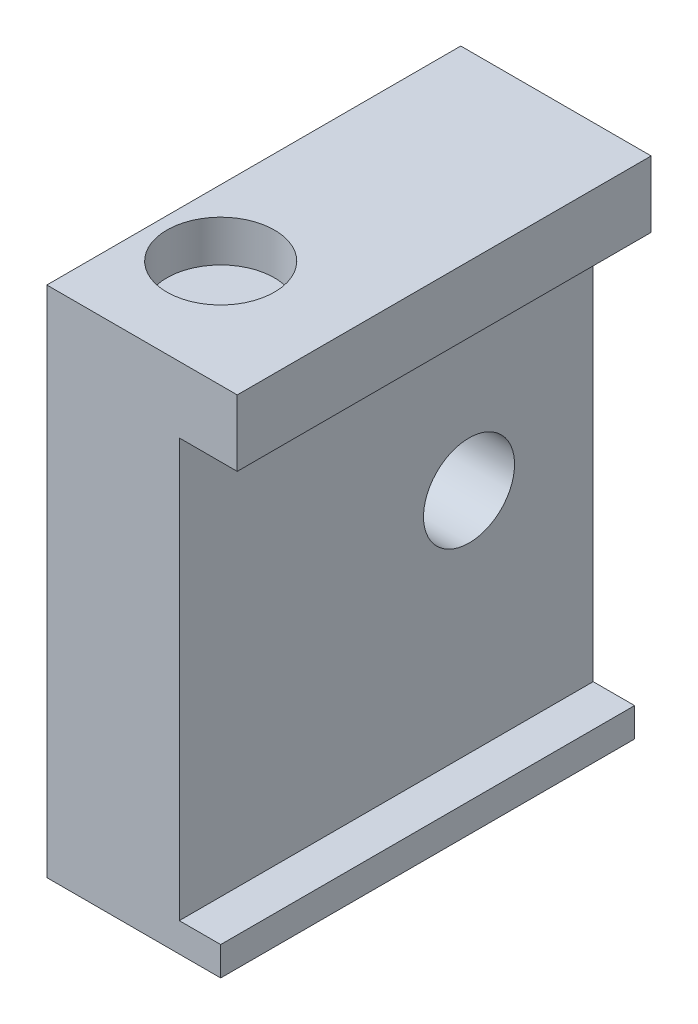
ISO-10303-21;
HEADER;
FILE_DESCRIPTION(('STEP AP214'),'2;1');
FILE_NAME('part.step','',(''),(''),'','','');
FILE_SCHEMA(('AUTOMOTIVE_DESIGN { 1 0 10303 214 1 1 1 1 }'));
ENDSEC;
DATA;
#1=APPLICATION_CONTEXT('core data for automotive mechanical design processes');
#2=APPLICATION_PROTOCOL_DEFINITION('international standard','automotive_design',2000,#1);
#3=PRODUCT_CONTEXT('',#1,'mechanical');
#4=PRODUCT('Part','Part','',(#3));
#5=PRODUCT_RELATED_PRODUCT_CATEGORY('part','',(#4));
#6=PRODUCT_DEFINITION_FORMATION('','',#4);
#7=PRODUCT_DEFINITION_CONTEXT('part definition',#1,'design');
#8=PRODUCT_DEFINITION('design','',#6,#7);
#9=PRODUCT_DEFINITION_SHAPE('','',#8);
#10=(LENGTH_UNIT() NAMED_UNIT(*) SI_UNIT(.MILLI.,.METRE.));
#11=(NAMED_UNIT(*) PLANE_ANGLE_UNIT() SI_UNIT($,.RADIAN.));
#12=(NAMED_UNIT(*) SI_UNIT($,.STERADIAN.) SOLID_ANGLE_UNIT());
#13=UNCERTAINTY_MEASURE_WITH_UNIT(LENGTH_MEASURE(1.E-05),#10,'distance_accuracy_value','');
#14=(GEOMETRIC_REPRESENTATION_CONTEXT(3) GLOBAL_UNCERTAINTY_ASSIGNED_CONTEXT((#13)) GLOBAL_UNIT_ASSIGNED_CONTEXT((#10,
#11,#12)) REPRESENTATION_CONTEXT('',''));
#15=CARTESIAN_POINT('',(0.,0.,0.));
#16=DIRECTION('',(0.,0.,1.));
#17=DIRECTION('',(1.,0.,0.));
#18=AXIS2_PLACEMENT_3D('',#15,#16,#17);
#19=CARTESIAN_POINT('',(23.,62.,-50.));
#20=DIRECTION('',(0.,1.,0.));
#21=DIRECTION('',(0.,0.,1.));
#22=AXIS2_PLACEMENT_3D('',#19,#20,#21);
#23=PLANE('',#22);
#24=CARTESIAN_POINT('',(8.,62.,-13.));
#25=DIRECTION('',(0.,-1.,0.));
#26=DIRECTION('',(0.,0.,1.));
#27=AXIS2_PLACEMENT_3D('',#24,#25,#26);
#28=CIRCLE('',#27,6.5);
#29=CARTESIAN_POINT('',(8.,62.,-6.5));
#30=VERTEX_POINT('',#29);
#31=EDGE_CURVE('E226',#30,#30,#28,.T.);
#32=ORIENTED_EDGE('',*,*,#31,.T.);
#33=EDGE_LOOP('',(#32));
#34=FACE_BOUND('',#33,.T.);
#35=DIRECTION('',(1.,0.,0.));
#36=VECTOR('',#35,1.);
#37=CARTESIAN_POINT('',(23.,62.,0.));
#38=LINE('',#37,#36);
#39=CARTESIAN_POINT('',(0.,62.,0.));
#40=VERTEX_POINT('',#39);
#41=CARTESIAN_POINT('',(23.,62.,0.));
#42=VERTEX_POINT('',#41);
#43=EDGE_CURVE('E99',#40,#42,#38,.T.);
#44=ORIENTED_EDGE('',*,*,#43,.T.);
#45=DIRECTION('',(0.,0.,1.));
#46=VECTOR('',#45,1.);
#47=CARTESIAN_POINT('',(23.,62.,-50.));
#48=LINE('',#47,#46);
#49=CARTESIAN_POINT('',(23.,62.,-50.));
#50=VERTEX_POINT('',#49);
#51=EDGE_CURVE('E31',#50,#42,#48,.T.);
#52=ORIENTED_EDGE('',*,*,#51,.F.);
#53=DIRECTION('',(1.,0.,0.));
#54=VECTOR('',#53,1.);
#55=CARTESIAN_POINT('',(23.,62.,-50.));
#56=LINE('',#55,#54);
#57=CARTESIAN_POINT('',(0.,62.,-50.));
#58=VERTEX_POINT('',#57);
#59=EDGE_CURVE('E130',#58,#50,#56,.T.);
#60=ORIENTED_EDGE('',*,*,#59,.F.);
#61=DIRECTION('',(0.,0.,1.));
#62=VECTOR('',#61,1.);
#63=CARTESIAN_POINT('',(0.,62.,-50.));
#64=LINE('',#63,#62);
#65=EDGE_CURVE('E11',#58,#40,#64,.T.);
#66=ORIENTED_EDGE('',*,*,#65,.T.);
#67=EDGE_LOOP('',(#44,#52,#60,#66));
#68=FACE_BOUND('',#67,.T.);
#69=ADVANCED_FACE('F28',(#34,#68),#23,.T.);
#70=CARTESIAN_POINT('',(0.,62.,-50.));
#71=DIRECTION('',(-1.,0.,0.));
#72=DIRECTION('',(0.,0.,-1.));
#73=AXIS2_PLACEMENT_3D('',#70,#71,#72);
#74=PLANE('',#73);
#75=CARTESIAN_POINT('',(0.,31.,-35.));
#76=DIRECTION('',(1.,0.,0.));
#77=DIRECTION('',(0.,0.,-1.));
#78=AXIS2_PLACEMENT_3D('',#75,#76,#77);
#79=CIRCLE('',#78,5.5);
#80=CARTESIAN_POINT('',(0.,31.,-40.5));
#81=VERTEX_POINT('',#80);
#82=EDGE_CURVE('E112',#81,#81,#79,.T.);
#83=ORIENTED_EDGE('',*,*,#82,.T.);
#84=EDGE_LOOP('',(#83));
#85=FACE_BOUND('',#84,.T.);
#86=DIRECTION('',(0.,1.,0.));
#87=VECTOR('',#86,1.);
#88=CARTESIAN_POINT('',(0.,62.,0.));
#89=LINE('',#88,#87);
#90=CARTESIAN_POINT('',(0.,0.,0.));
#91=VERTEX_POINT('',#90);
#92=EDGE_CURVE('E128',#91,#40,#89,.T.);
#93=ORIENTED_EDGE('',*,*,#92,.T.);
#94=ORIENTED_EDGE('',*,*,#65,.F.);
#95=DIRECTION('',(0.,1.,0.));
#96=VECTOR('',#95,1.);
#97=CARTESIAN_POINT('',(0.,62.,-50.));
#98=LINE('',#97,#96);
#99=CARTESIAN_POINT('',(0.,0.,-50.));
#100=VERTEX_POINT('',#99);
#101=EDGE_CURVE('E44',#100,#58,#98,.T.);
#102=ORIENTED_EDGE('',*,*,#101,.F.);
#103=DIRECTION('',(0.,0.,1.));
#104=VECTOR('',#103,1.);
#105=CARTESIAN_POINT('',(0.,0.,-50.));
#106=LINE('',#105,#104);
#107=EDGE_CURVE('E36',#100,#91,#106,.T.);
#108=ORIENTED_EDGE('',*,*,#107,.T.);
#109=EDGE_LOOP('',(#93,#94,#102,#108));
#110=FACE_BOUND('',#109,.T.);
#111=ADVANCED_FACE('F179',(#85,#110),#74,.T.);
#112=CARTESIAN_POINT('',(21.,0.,-50.));
#113=DIRECTION('',(0.,-1.,0.));
#114=DIRECTION('',(0.,0.,-1.));
#115=AXIS2_PLACEMENT_3D('',#112,#113,#114);
#116=PLANE('',#115);
#117=DIRECTION('',(-1.,0.,0.));
#118=VECTOR('',#117,1.);
#119=CARTESIAN_POINT('',(21.,0.,0.));
#120=LINE('',#119,#118);
#121=CARTESIAN_POINT('',(21.,0.,0.));
#122=VERTEX_POINT('',#121);
#123=EDGE_CURVE('E126',#122,#91,#120,.T.);
#124=ORIENTED_EDGE('',*,*,#123,.T.);
#125=ORIENTED_EDGE('',*,*,#107,.F.);
#126=DIRECTION('',(-1.,0.,0.));
#127=VECTOR('',#126,1.);
#128=CARTESIAN_POINT('',(21.,0.,-50.));
#129=LINE('',#128,#127);
#130=CARTESIAN_POINT('',(21.,0.,-50.));
#131=VERTEX_POINT('',#130);
#132=EDGE_CURVE('E49',#131,#100,#129,.T.);
#133=ORIENTED_EDGE('',*,*,#132,.F.);
#134=DIRECTION('',(0.,0.,1.));
#135=VECTOR('',#134,1.);
#136=CARTESIAN_POINT('',(21.,0.,-50.));
#137=LINE('',#136,#135);
#138=EDGE_CURVE('E145',#131,#122,#137,.T.);
#139=ORIENTED_EDGE('',*,*,#138,.T.);
#140=EDGE_LOOP('',(#124,#125,#133,#139));
#141=FACE_BOUND('',#140,.T.);
#142=ADVANCED_FACE('F177',(#141),#116,.T.);
#143=CARTESIAN_POINT('',(21.,3.5,-50.));
#144=DIRECTION('',(1.,0.,0.));
#145=DIRECTION('',(0.,-1.,0.));
#146=AXIS2_PLACEMENT_3D('',#143,#144,#145);
#147=PLANE('',#146);
#148=DIRECTION('',(0.,-1.,0.));
#149=VECTOR('',#148,1.);
#150=CARTESIAN_POINT('',(21.,3.5,0.));
#151=LINE('',#150,#149);
#152=CARTESIAN_POINT('',(21.,3.5,0.));
#153=VERTEX_POINT('',#152);
#154=EDGE_CURVE('E124',#153,#122,#151,.T.);
#155=ORIENTED_EDGE('',*,*,#154,.T.);
#156=ORIENTED_EDGE('',*,*,#138,.F.);
#157=DIRECTION('',(0.,-1.,0.));
#158=VECTOR('',#157,1.);
#159=CARTESIAN_POINT('',(21.,3.5,-50.));
#160=LINE('',#159,#158);
#161=CARTESIAN_POINT('',(21.,3.5,-50.));
#162=VERTEX_POINT('',#161);
#163=EDGE_CURVE('E139',#162,#131,#160,.T.);
#164=ORIENTED_EDGE('',*,*,#163,.F.);
#165=DIRECTION('',(0.,0.,1.));
#166=VECTOR('',#165,1.);
#167=CARTESIAN_POINT('',(21.,3.5,-50.));
#168=LINE('',#167,#166);
#169=EDGE_CURVE('E148',#162,#153,#168,.T.);
#170=ORIENTED_EDGE('',*,*,#169,.T.);
#171=EDGE_LOOP('',(#155,#156,#164,#170));
#172=FACE_BOUND('',#171,.T.);
#173=ADVANCED_FACE('F174',(#172),#147,.T.);
#174=CARTESIAN_POINT('',(21.,3.5,-50.));
#175=DIRECTION('',(0.,1.,0.));
#176=DIRECTION('',(0.,0.,1.));
#177=AXIS2_PLACEMENT_3D('',#174,#175,#176);
#178=PLANE('',#177);
#179=DIRECTION('',(1.,0.,0.));
#180=VECTOR('',#179,1.);
#181=CARTESIAN_POINT('',(21.,3.5,0.));
#182=LINE('',#181,#180);
#183=CARTESIAN_POINT('',(16.,3.5,0.));
#184=VERTEX_POINT('',#183);
#185=EDGE_CURVE('E122',#184,#153,#182,.T.);
#186=ORIENTED_EDGE('',*,*,#185,.T.);
#187=ORIENTED_EDGE('',*,*,#169,.F.);
#188=DIRECTION('',(1.,0.,0.));
#189=VECTOR('',#188,1.);
#190=CARTESIAN_POINT('',(21.,3.5,-50.));
#191=LINE('',#190,#189);
#192=CARTESIAN_POINT('',(16.,3.5,-50.));
#193=VERTEX_POINT('',#192);
#194=EDGE_CURVE('E137',#193,#162,#191,.T.);
#195=ORIENTED_EDGE('',*,*,#194,.F.);
#196=DIRECTION('',(0.,0.,1.));
#197=VECTOR('',#196,1.);
#198=CARTESIAN_POINT('',(16.,3.5,-50.));
#199=LINE('',#198,#197);
#200=EDGE_CURVE('E151',#193,#184,#199,.T.);
#201=ORIENTED_EDGE('',*,*,#200,.T.);
#202=EDGE_LOOP('',(#186,#187,#195,#201));
#203=FACE_BOUND('',#202,.T.);
#204=ADVANCED_FACE('F169',(#203),#178,.T.);
#205=CARTESIAN_POINT('',(16.,54.,-50.));
#206=DIRECTION('',(1.,0.,0.));
#207=DIRECTION('',(0.,-1.,0.));
#208=AXIS2_PLACEMENT_3D('',#205,#206,#207);
#209=PLANE('',#208);
#210=CARTESIAN_POINT('',(16.,31.,-35.));
#211=DIRECTION('',(-1.,0.,0.));
#212=DIRECTION('',(0.,-1.,0.));
#213=AXIS2_PLACEMENT_3D('',#210,#211,#212);
#214=CIRCLE('',#213,5.5);
#215=CARTESIAN_POINT('',(16.,25.5,-35.));
#216=VERTEX_POINT('',#215);
#217=EDGE_CURVE('E115',#216,#216,#214,.T.);
#218=ORIENTED_EDGE('',*,*,#217,.T.);
#219=EDGE_LOOP('',(#218));
#220=FACE_BOUND('',#219,.T.);
#221=DIRECTION('',(0.,-1.,0.));
#222=VECTOR('',#221,1.);
#223=CARTESIAN_POINT('',(16.,54.,0.));
#224=LINE('',#223,#222);
#225=CARTESIAN_POINT('',(16.,54.,0.));
#226=VERTEX_POINT('',#225);
#227=EDGE_CURVE('E120',#226,#184,#224,.T.);
#228=ORIENTED_EDGE('',*,*,#227,.T.);
#229=ORIENTED_EDGE('',*,*,#200,.F.);
#230=DIRECTION('',(0.,-1.,0.));
#231=VECTOR('',#230,1.);
#232=CARTESIAN_POINT('',(16.,54.,-50.));
#233=LINE('',#232,#231);
#234=CARTESIAN_POINT('',(16.,54.,-50.));
#235=VERTEX_POINT('',#234);
#236=EDGE_CURVE('E135',#235,#193,#233,.T.);
#237=ORIENTED_EDGE('',*,*,#236,.F.);
#238=DIRECTION('',(0.,0.,1.));
#239=VECTOR('',#238,1.);
#240=CARTESIAN_POINT('',(16.,54.,-50.));
#241=LINE('',#240,#239);
#242=EDGE_CURVE('E154',#235,#226,#241,.T.);
#243=ORIENTED_EDGE('',*,*,#242,.T.);
#244=EDGE_LOOP('',(#228,#229,#237,#243));
#245=FACE_BOUND('',#244,.T.);
#246=ADVANCED_FACE('F166',(#220,#245),#209,.T.);
#247=CARTESIAN_POINT('',(16.,54.,-50.));
#248=DIRECTION('',(0.,-1.,0.));
#249=DIRECTION('',(0.,0.,-1.));
#250=AXIS2_PLACEMENT_3D('',#247,#248,#249);
#251=PLANE('',#250);
#252=DIRECTION('',(-1.,0.,0.));
#253=VECTOR('',#252,1.);
#254=CARTESIAN_POINT('',(16.,54.,0.));
#255=LINE('',#254,#253);
#256=CARTESIAN_POINT('',(23.,54.,0.));
#257=VERTEX_POINT('',#256);
#258=EDGE_CURVE('E101',#257,#226,#255,.T.);
#259=ORIENTED_EDGE('',*,*,#258,.T.);
#260=ORIENTED_EDGE('',*,*,#242,.F.);
#261=DIRECTION('',(-1.,0.,0.));
#262=VECTOR('',#261,1.);
#263=CARTESIAN_POINT('',(16.,54.,-50.));
#264=LINE('',#263,#262);
#265=CARTESIAN_POINT('',(23.,54.,-50.));
#266=VERTEX_POINT('',#265);
#267=EDGE_CURVE('E133',#266,#235,#264,.T.);
#268=ORIENTED_EDGE('',*,*,#267,.F.);
#269=DIRECTION('',(0.,0.,1.));
#270=VECTOR('',#269,1.);
#271=CARTESIAN_POINT('',(23.,54.,-50.));
#272=LINE('',#271,#270);
#273=EDGE_CURVE('E111',#266,#257,#272,.T.);
#274=ORIENTED_EDGE('',*,*,#273,.T.);
#275=EDGE_LOOP('',(#259,#260,#268,#274));
#276=FACE_BOUND('',#275,.T.);
#277=ADVANCED_FACE('F158',(#276),#251,.T.);
#278=CARTESIAN_POINT('',(23.,54.,-50.));
#279=DIRECTION('',(1.,0.,0.));
#280=DIRECTION('',(0.,0.,1.));
#281=AXIS2_PLACEMENT_3D('',#278,#279,#280);
#282=PLANE('',#281);
#283=DIRECTION('',(0.,-1.,0.));
#284=VECTOR('',#283,1.);
#285=CARTESIAN_POINT('',(23.,54.,0.));
#286=LINE('',#285,#284);
#287=EDGE_CURVE('E94',#42,#257,#286,.T.);
#288=ORIENTED_EDGE('',*,*,#287,.T.);
#289=ORIENTED_EDGE('',*,*,#273,.F.);
#290=DIRECTION('',(0.,-1.,0.));
#291=VECTOR('',#290,1.);
#292=CARTESIAN_POINT('',(23.,54.,-50.));
#293=LINE('',#292,#291);
#294=EDGE_CURVE('E108',#50,#266,#293,.T.);
#295=ORIENTED_EDGE('',*,*,#294,.F.);
#296=ORIENTED_EDGE('',*,*,#51,.T.);
#297=EDGE_LOOP('',(#288,#289,#295,#296));
#298=FACE_BOUND('',#297,.T.);
#299=ADVANCED_FACE('F107',(#298),#282,.T.);
#300=CARTESIAN_POINT('',(0.,62.,-50.));
#301=DIRECTION('',(0.,0.,-1.));
#302=DIRECTION('',(1.,0.,0.));
#303=AXIS2_PLACEMENT_3D('',#300,#301,#302);
#304=PLANE('',#303);
#305=ORIENTED_EDGE('',*,*,#59,.T.);
#306=ORIENTED_EDGE('',*,*,#294,.T.);
#307=ORIENTED_EDGE('',*,*,#267,.T.);
#308=ORIENTED_EDGE('',*,*,#236,.T.);
#309=ORIENTED_EDGE('',*,*,#194,.T.);
#310=ORIENTED_EDGE('',*,*,#163,.T.);
#311=ORIENTED_EDGE('',*,*,#132,.T.);
#312=ORIENTED_EDGE('',*,*,#101,.T.);
#313=EDGE_LOOP('',(#305,#306,#307,#308,#309,#310,#311,#312));
#314=FACE_BOUND('',#313,.T.);
#315=ADVANCED_FACE('F161',(#314),#304,.T.);
#316=CARTESIAN_POINT('',(0.,62.,0.));
#317=DIRECTION('',(0.,0.,-1.));
#318=DIRECTION('',(1.,0.,0.));
#319=AXIS2_PLACEMENT_3D('',#316,#317,#318);
#320=PLANE('',#319);
#321=ORIENTED_EDGE('',*,*,#43,.F.);
#322=ORIENTED_EDGE('',*,*,#92,.F.);
#323=ORIENTED_EDGE('',*,*,#123,.F.);
#324=ORIENTED_EDGE('',*,*,#154,.F.);
#325=ORIENTED_EDGE('',*,*,#185,.F.);
#326=ORIENTED_EDGE('',*,*,#227,.F.);
#327=ORIENTED_EDGE('',*,*,#258,.F.);
#328=ORIENTED_EDGE('',*,*,#287,.F.);
#329=EDGE_LOOP('',(#321,#322,#323,#324,#325,#326,#327,#328));
#330=FACE_BOUND('',#329,.T.);
#331=ADVANCED_FACE('F96',(#330),#320,.F.);
#332=CARTESIAN_POINT('',(-34.,31.,-35.));
#333=DIRECTION('',(1.,0.,0.));
#334=DIRECTION('',(0.,-1.,0.));
#335=AXIS2_PLACEMENT_3D('',#332,#333,#334);
#336=CYLINDRICAL_SURFACE('',#335,5.5);
#337=ORIENTED_EDGE('',*,*,#82,.F.);
#338=EDGE_LOOP('',(#337));
#339=FACE_BOUND('',#338,.T.);
#340=ORIENTED_EDGE('',*,*,#217,.F.);
#341=EDGE_LOOP('',(#340));
#342=FACE_BOUND('',#341,.T.);
#343=ADVANCED_FACE('F207',(#339,#342),#336,.F.);
#344=CARTESIAN_POINT('',(8.,57.,-13.));
#345=DIRECTION('',(0.,1.,0.));
#346=DIRECTION('',(0.,0.,1.));
#347=AXIS2_PLACEMENT_3D('',#344,#345,#346);
#348=CYLINDRICAL_SURFACE('',#347,6.5);
#349=CARTESIAN_POINT('',(8.,57.,-13.));
#350=DIRECTION('',(0.,-1.,0.));
#351=DIRECTION('',(0.,0.,1.));
#352=AXIS2_PLACEMENT_3D('',#349,#350,#351);
#353=CIRCLE('',#352,6.5);
#354=CARTESIAN_POINT('',(8.,57.,-6.5));
#355=VERTEX_POINT('',#354);
#356=EDGE_CURVE('E225',#355,#355,#353,.T.);
#357=ORIENTED_EDGE('',*,*,#356,.T.);
#358=EDGE_LOOP('',(#357));
#359=FACE_BOUND('',#358,.T.);
#360=ORIENTED_EDGE('',*,*,#31,.F.);
#361=EDGE_LOOP('',(#360));
#362=FACE_BOUND('',#361,.T.);
#363=ADVANCED_FACE('F211',(#359,#362),#348,.F.);
#364=CARTESIAN_POINT('',(8.,57.,-13.));
#365=DIRECTION('',(0.,1.,0.));
#366=DIRECTION('',(0.,0.,1.));
#367=AXIS2_PLACEMENT_3D('',#364,#365,#366);
#368=PLANE('',#367);
#369=ORIENTED_EDGE('',*,*,#356,.F.);
#370=EDGE_LOOP('',(#369));
#371=FACE_BOUND('',#370,.T.);
#372=ADVANCED_FACE('F217',(#371),#368,.T.);
#373=CLOSED_SHELL('',(#69,#111,#142,#173,#204,#246,#277,#299,#315,#331,#343,#363,#372));
#374=MANIFOLD_SOLID_BREP('B2',#373);
#375=ADVANCED_BREP_SHAPE_REPRESENTATION('',(#18,#374),#14);
#376=SHAPE_DEFINITION_REPRESENTATION(#9,#375);
ENDSEC;
END-ISO-10303-21;
